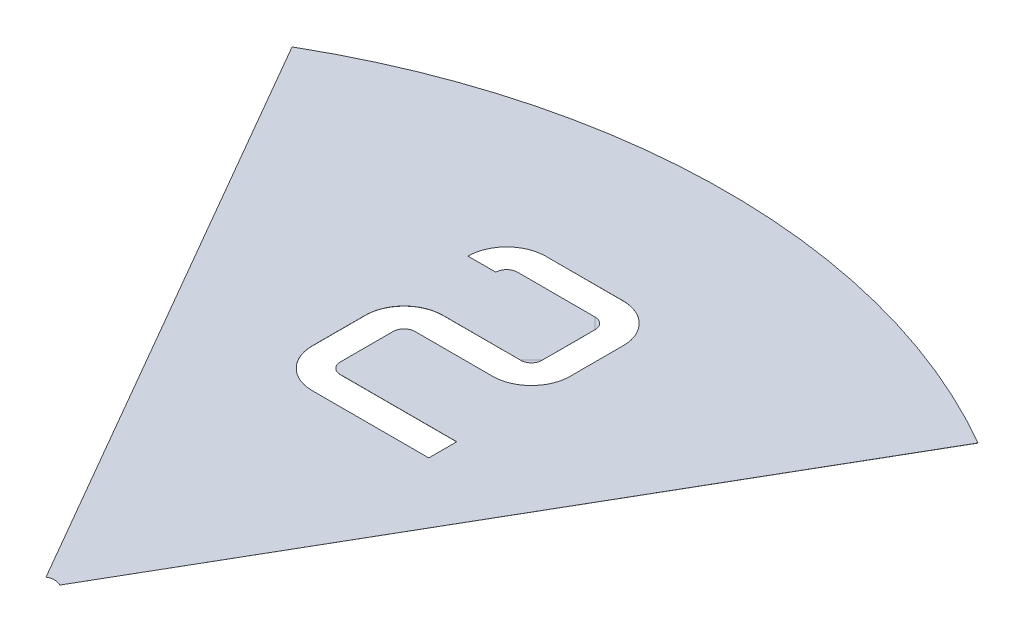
ISO-10303-21;
HEADER;
FILE_DESCRIPTION(('STEP AP214'),'2;1');
FILE_NAME('part.step','',(''),(''),'','','');
FILE_SCHEMA(('AUTOMOTIVE_DESIGN { 1 0 10303 214 1 1 1 1 }'));
ENDSEC;
DATA;
#1=APPLICATION_CONTEXT('core data for automotive mechanical design processes');
#2=APPLICATION_PROTOCOL_DEFINITION('international standard','automotive_design',2000,#1);
#3=PRODUCT_CONTEXT('',#1,'mechanical');
#4=PRODUCT('Part','Part','',(#3));
#5=PRODUCT_RELATED_PRODUCT_CATEGORY('part','',(#4));
#6=PRODUCT_DEFINITION_FORMATION('','',#4);
#7=PRODUCT_DEFINITION_CONTEXT('part definition',#1,'design');
#8=PRODUCT_DEFINITION('design','',#6,#7);
#9=PRODUCT_DEFINITION_SHAPE('','',#8);
#10=(LENGTH_UNIT() NAMED_UNIT(*) SI_UNIT(.MILLI.,.METRE.));
#11=(NAMED_UNIT(*) PLANE_ANGLE_UNIT() SI_UNIT($,.RADIAN.));
#12=(NAMED_UNIT(*) SI_UNIT($,.STERADIAN.) SOLID_ANGLE_UNIT());
#13=UNCERTAINTY_MEASURE_WITH_UNIT(LENGTH_MEASURE(1.E-05),#10,'distance_accuracy_value','');
#14=(GEOMETRIC_REPRESENTATION_CONTEXT(3) GLOBAL_UNCERTAINTY_ASSIGNED_CONTEXT((#13)) GLOBAL_UNIT_ASSIGNED_CONTEXT((#10,
#11,#12)) REPRESENTATION_CONTEXT('',''));
#15=CARTESIAN_POINT('',(0.,0.,0.));
#16=DIRECTION('',(0.,0.,1.));
#17=DIRECTION('',(1.,0.,0.));
#18=AXIS2_PLACEMENT_3D('',#15,#16,#17);
#19=CARTESIAN_POINT('',(-9.5843847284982,-10.5069257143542,12.2025933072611));
#20=DIRECTION('',(0.,1.,0.));
#21=DIRECTION('',(0.,0.,1.));
#22=AXIS2_PLACEMENT_3D('',#19,#20,#21);
#23=PLANE('',#22);
#24=CARTESIAN_POINT('',(-12.1469938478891,-10.5169257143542,-27.1362681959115));
#25=CARTESIAN_POINT('',(-12.6875323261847,-10.5169257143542,-27.1361535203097));
#26=CARTESIAN_POINT('',(-13.188885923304,-10.5169257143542,-26.9375339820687));
#27=CARTESIAN_POINT('',(-13.7345321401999,-10.5169257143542,-26.7213671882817));
#28=CARTESIAN_POINT('',(-14.1484595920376,-10.5169257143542,-26.30723394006));
#29=CARTESIAN_POINT('',(-14.5633603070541,-10.5169257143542,-25.8921269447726));
#30=CARTESIAN_POINT('',(-14.7787596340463,-10.5169257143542,-25.3476602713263));
#31=CARTESIAN_POINT('',(-14.9773793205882,-10.5169257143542,-24.8456076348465));
#32=CARTESIAN_POINT('',(-14.9774938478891,-10.5169257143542,-24.3057681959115));
#33=B_SPLINE_CURVE_WITH_KNOTS('',2,(#24,#25,#26,#27,#28,#29,#30,#31,#32),.UNSPECIFIED.,.F.,.F.,
(3,2,2,2,3),(0.,0.25,0.5,0.75,1.),.UNSPECIFIED.);
#34=CARTESIAN_POINT('',(-12.1469938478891,-10.5119257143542,-27.1362681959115));
#35=VERTEX_POINT('',#34);
#36=CARTESIAN_POINT('',(-14.9774938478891,-10.5119257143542,-24.3057681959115));
#37=VERTEX_POINT('',#36);
#38=EDGE_CURVE('E167',#35,#37,#33,.T.);
#39=ORIENTED_EDGE('',*,*,#38,.F.);
#40=DIRECTION('',(-1.,0.,0.));
#41=VECTOR('',#40,1.);
#42=CARTESIAN_POINT('',(-12.1469938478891,-10.5069257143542,-27.1362681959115));
#43=LINE('',#42,#41);
#44=CARTESIAN_POINT('',(-6.48599384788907,-10.5069257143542,-27.1362681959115));
#45=VERTEX_POINT('',#44);
#46=EDGE_CURVE('E377',#45,#35,#43,.T.);
#47=ORIENTED_EDGE('',*,*,#46,.F.);
#48=CARTESIAN_POINT('',(-6.48599384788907,-10.5069257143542,-24.3057681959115));
#49=DIRECTION('',(0.,1.,0.));
#50=DIRECTION('',(0.,0.,-1.));
#51=AXIS2_PLACEMENT_3D('',#48,#49,#50);
#52=CIRCLE('',#51,2.8305);
#53=CARTESIAN_POINT('',(-3.65549384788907,-10.5069257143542,-24.3057681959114));
#54=VERTEX_POINT('',#53);
#55=EDGE_CURVE('E380',#54,#45,#52,.T.);
#56=ORIENTED_EDGE('',*,*,#55,.F.);
#57=DIRECTION('',(0.,0.,-1.));
#58=VECTOR('',#57,1.);
#59=CARTESIAN_POINT('',(-3.65549384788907,-10.5069257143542,-24.3057681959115));
#60=LINE('',#59,#58);
#61=CARTESIAN_POINT('',(-3.65549384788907,-10.5069257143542,-20.4467681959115));
#62=VERTEX_POINT('',#61);
#63=EDGE_CURVE('E390',#62,#54,#60,.T.);
#64=ORIENTED_EDGE('',*,*,#63,.F.);
#65=CARTESIAN_POINT('',(-6.48599384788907,-10.5069257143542,-20.4467681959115));
#66=DIRECTION('',(0.,1.,0.));
#67=DIRECTION('',(0.,0.,-1.));
#68=AXIS2_PLACEMENT_3D('',#65,#66,#67);
#69=CIRCLE('',#68,2.8305);
#70=CARTESIAN_POINT('',(-6.48599384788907,-10.5069257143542,-17.6162681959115));
#71=VERTEX_POINT('',#70);
#72=EDGE_CURVE('E395',#71,#62,#69,.T.);
#73=ORIENTED_EDGE('',*,*,#72,.F.);
#74=DIRECTION('',(1.,0.,0.));
#75=VECTOR('',#74,1.);
#76=CARTESIAN_POINT('',(-12.1469938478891,-10.5069257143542,-17.6162681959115));
#77=LINE('',#76,#75);
#78=CARTESIAN_POINT('',(-12.1469938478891,-10.5069257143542,-17.6162681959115));
#79=VERTEX_POINT('',#78);
#80=EDGE_CURVE('E400',#79,#71,#77,.T.);
#81=ORIENTED_EDGE('',*,*,#80,.F.);
#82=CARTESIAN_POINT('',(-12.1469938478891,-10.5069257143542,-16.8257681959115));
#83=DIRECTION('',(0.,-1.,0.));
#84=DIRECTION('',(0.,0.,-1.));
#85=AXIS2_PLACEMENT_3D('',#82,#83,#84);
#86=CIRCLE('',#85,0.7905);
#87=CARTESIAN_POINT('',(-12.9374938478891,-10.5069257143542,-16.8257681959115));
#88=VERTEX_POINT('',#87);
#89=EDGE_CURVE('E405',#88,#79,#86,.T.);
#90=ORIENTED_EDGE('',*,*,#89,.F.);
#91=DIRECTION('',(0.,0.,-1.));
#92=VECTOR('',#91,1.);
#93=CARTESIAN_POINT('',(-12.9374938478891,-10.5069257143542,-12.9667681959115));
#94=LINE('',#93,#92);
#95=CARTESIAN_POINT('',(-12.9374938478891,-10.5069257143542,-12.9667681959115));
#96=VERTEX_POINT('',#95);
#97=EDGE_CURVE('E410',#96,#88,#94,.T.);
#98=ORIENTED_EDGE('',*,*,#97,.F.);
#99=CARTESIAN_POINT('',(-12.1469938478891,-10.5069257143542,-12.9667681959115));
#100=DIRECTION('',(0.,-1.,0.));
#101=DIRECTION('',(0.,0.,1.));
#102=AXIS2_PLACEMENT_3D('',#99,#100,#101);
#103=CIRCLE('',#102,0.7905);
#104=CARTESIAN_POINT('',(-12.1469938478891,-10.5069257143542,-12.1762681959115));
#105=VERTEX_POINT('',#104);
#106=EDGE_CURVE('E415',#105,#96,#103,.T.);
#107=ORIENTED_EDGE('',*,*,#106,.F.);
#108=DIRECTION('',(-1.,0.,0.));
#109=VECTOR('',#108,1.);
#110=CARTESIAN_POINT('',(-3.65549384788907,-10.5069257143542,-12.1762681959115));
#111=LINE('',#110,#109);
#112=CARTESIAN_POINT('',(-3.65549384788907,-10.5069257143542,-12.1762681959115));
#113=VERTEX_POINT('',#112);
#114=EDGE_CURVE('E412',#113,#105,#111,.T.);
#115=ORIENTED_EDGE('',*,*,#114,.F.);
#116=DIRECTION('',(0.,0.,-1.));
#117=VECTOR('',#116,1.);
#118=CARTESIAN_POINT('',(-3.65549384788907,-10.5069257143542,-12.1762681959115));
#119=LINE('',#118,#117);
#120=CARTESIAN_POINT('',(-3.65549384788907,-10.5069257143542,-10.1362681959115));
#121=VERTEX_POINT('',#120);
#122=EDGE_CURVE('E421',#121,#113,#119,.T.);
#123=ORIENTED_EDGE('',*,*,#122,.F.);
#124=DIRECTION('',(1.,0.,0.));
#125=VECTOR('',#124,1.);
#126=CARTESIAN_POINT('',(-3.65549384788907,-10.5069257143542,-10.1362681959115));
#127=LINE('',#126,#125);
#128=CARTESIAN_POINT('',(-12.1469938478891,-10.5069257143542,-10.1362681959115));
#129=VERTEX_POINT('',#128);
#130=EDGE_CURVE('E454',#129,#121,#127,.T.);
#131=ORIENTED_EDGE('',*,*,#130,.F.);
#132=CARTESIAN_POINT('',(-12.1469938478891,-10.5069257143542,-12.9667681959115));
#133=DIRECTION('',(0.,1.,0.));
#134=DIRECTION('',(0.,0.,1.));
#135=AXIS2_PLACEMENT_3D('',#132,#133,#134);
#136=CIRCLE('',#135,2.8305);
#137=CARTESIAN_POINT('',(-14.9774938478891,-10.5069257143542,-12.9667681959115));
#138=VERTEX_POINT('',#137);
#139=EDGE_CURVE('E448',#138,#129,#136,.T.);
#140=ORIENTED_EDGE('',*,*,#139,.F.);
#141=DIRECTION('',(-0.000685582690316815,0.,0.99999976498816));
#142=VECTOR('',#141,1.);
#143=CARTESIAN_POINT('',(-14.9774938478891,-10.5069257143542,-12.9667681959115));
#144=LINE('',#143,#142);
#145=CARTESIAN_POINT('',(-14.9749307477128,-10.5069257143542,-16.705339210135));
#146=VERTEX_POINT('',#145);
#147=EDGE_CURVE('E442',#146,#138,#144,.T.);
#148=ORIENTED_EDGE('',*,*,#147,.F.);
#149=CARTESIAN_POINT('',(-12.1469938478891,-10.5069257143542,-16.8257681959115));
#150=DIRECTION('',(0.,1.,0.));
#151=DIRECTION('',(0.,0.,1.));
#152=AXIS2_PLACEMENT_3D('',#149,#150,#151);
#153=CIRCLE('',#152,2.8305);
#154=CARTESIAN_POINT('',(-12.1469938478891,-10.5069257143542,-19.6562681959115));
#155=VERTEX_POINT('',#154);
#156=EDGE_CURVE('E434',#155,#146,#153,.T.);
#157=ORIENTED_EDGE('',*,*,#156,.F.);
#158=DIRECTION('',(-1.,0.,0.));
#159=VECTOR('',#158,1.);
#160=CARTESIAN_POINT('',(-12.1469938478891,-10.5069257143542,-19.6562681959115));
#161=LINE('',#160,#159);
#162=CARTESIAN_POINT('',(-6.48599384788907,-10.5119257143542,-19.6562681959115));
#163=VERTEX_POINT('',#162);
#164=EDGE_CURVE('E431',#163,#155,#161,.T.);
#165=ORIENTED_EDGE('',*,*,#164,.F.);
#166=CARTESIAN_POINT('',(-5.69549384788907,-10.5169257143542,-20.4467681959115));
#167=CARTESIAN_POINT('',(-5.69682991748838,-10.5169257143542,-20.1158325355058));
#168=CARTESIAN_POINT('',(-5.92702593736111,-10.5169257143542,-19.8878002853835));
#169=CARTESIAN_POINT('',(-6.15942405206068,-10.5169257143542,-19.657586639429));
#170=CARTESIAN_POINT('',(-6.48599384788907,-10.5169257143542,-19.6562681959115));
#171=B_SPLINE_CURVE_WITH_KNOTS('',2,(#166,#167,#168,#169,#170),.UNSPECIFIED.,.F.,.F.,(3,2,3),
(0.,0.5,1.),.UNSPECIFIED.);
#172=CARTESIAN_POINT('',(-5.69549384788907,-10.5119257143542,-20.4467681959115));
#173=VERTEX_POINT('',#172);
#174=EDGE_CURVE('E234',#173,#163,#171,.T.);
#175=ORIENTED_EDGE('',*,*,#174,.F.);
#176=DIRECTION('',(0.,0.,1.));
#177=VECTOR('',#176,1.);
#178=CARTESIAN_POINT('',(-5.69549384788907,-10.5069257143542,-24.3057681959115));
#179=LINE('',#178,#177);
#180=CARTESIAN_POINT('',(-5.69549384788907,-10.5119257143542,-24.3057681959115));
#181=VERTEX_POINT('',#180);
#182=EDGE_CURVE('E375',#181,#173,#179,.T.);
#183=ORIENTED_EDGE('',*,*,#182,.F.);
#184=CARTESIAN_POINT('',(-6.48599384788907,-10.5169257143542,-25.0962681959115));
#185=CARTESIAN_POINT('',(-6.15505818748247,-10.5169257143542,-25.0949321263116));
#186=CARTESIAN_POINT('',(-5.92702593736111,-10.5169257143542,-24.8647361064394));
#187=CARTESIAN_POINT('',(-5.69681229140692,-10.5169257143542,-24.6323379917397));
#188=CARTESIAN_POINT('',(-5.69549384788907,-10.5169257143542,-24.3057681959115));
#189=B_SPLINE_CURVE_WITH_KNOTS('',2,(#184,#185,#186,#187,#188),.UNSPECIFIED.,.F.,.F.,(3,2,3),
(0.,0.5,1.),.UNSPECIFIED.);
#190=CARTESIAN_POINT('',(-6.48599384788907,-10.5119257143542,-25.0962681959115));
#191=VERTEX_POINT('',#190);
#192=EDGE_CURVE('E248',#191,#181,#189,.T.);
#193=ORIENTED_EDGE('',*,*,#192,.F.);
#194=DIRECTION('',(1.,0.,0.));
#195=VECTOR('',#194,1.);
#196=CARTESIAN_POINT('',(-12.1469938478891,-10.5069257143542,-25.0962681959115));
#197=LINE('',#196,#195);
#198=CARTESIAN_POINT('',(-12.1469938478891,-10.5069257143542,-25.0962681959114));
#199=VERTEX_POINT('',#198);
#200=EDGE_CURVE('E173',#199,#191,#197,.T.);
#201=ORIENTED_EDGE('',*,*,#200,.F.);
#202=CARTESIAN_POINT('',(-12.1469938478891,-10.5069257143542,-24.3057681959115));
#203=DIRECTION('',(0.,-1.,0.));
#204=DIRECTION('',(0.,0.,1.));
#205=AXIS2_PLACEMENT_3D('',#202,#203,#204);
#206=CIRCLE('',#205,0.7905);
#207=CARTESIAN_POINT('',(-12.9374938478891,-10.5069257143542,-24.3057681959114));
#208=VERTEX_POINT('',#207);
#209=EDGE_CURVE('E170',#208,#199,#206,.T.);
#210=ORIENTED_EDGE('',*,*,#209,.F.);
#211=DIRECTION('',(1.,0.,0.));
#212=VECTOR('',#211,1.);
#213=CARTESIAN_POINT('',(-14.9774938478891,-10.5069257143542,-24.3057681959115));
#214=LINE('',#213,#212);
#215=EDGE_CURVE('E162',#37,#208,#214,.T.);
#216=ORIENTED_EDGE('',*,*,#215,.F.);
#217=EDGE_LOOP('',(#39,#47,#56,#64,#73,#81,#90,#98,#107,#115,#123,#131,#140,#148,#157,#165,#175,
#183,#193,#201,#210,#216));
#218=FACE_BOUND('',#217,.T.);
#219=CARTESIAN_POINT('',(-10.0843847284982,-10.5069257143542,11.3365679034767));
#220=CARTESIAN_POINT('',(-9.84938651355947,-10.5069257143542,11.2017838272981));
#221=CARTESIAN_POINT('',(-9.58438472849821,-10.5069257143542,11.2025933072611));
#222=CARTESIAN_POINT('',(-9.31654514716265,-10.5069257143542,11.2034114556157));
#223=CARTESIAN_POINT('',(-9.08438472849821,-10.5069257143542,11.3365679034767));
#224=B_SPLINE_CURVE_WITH_KNOTS('',2,(#219,#220,#221,#222,#223),.UNSPECIFIED.,.F.,.F.,(3,2,3),
(0.,0.5,1.),.UNSPECIFIED.);
#225=CARTESIAN_POINT('',(-10.0843847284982,-10.5119257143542,11.3365679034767));
#226=VERTEX_POINT('',#225);
#227=CARTESIAN_POINT('',(-9.08438472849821,-10.5119257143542,11.3365679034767));
#228=VERTEX_POINT('',#227);
#229=EDGE_CURVE('E26',#226,#228,#224,.T.);
#230=ORIENTED_EDGE('',*,*,#229,.T.);
#231=DIRECTION('',(0.499999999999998,0.,-0.86602540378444));
#232=VECTOR('',#231,1.);
#233=CARTESIAN_POINT('',(-9.08438472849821,-10.5069257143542,11.3365679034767));
#234=LINE('',#233,#232);
#235=CARTESIAN_POINT('',(15.4156152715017,-10.5069257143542,-31.0986768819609));
#236=VERTEX_POINT('',#235);
#237=EDGE_CURVE('E191',#228,#236,#234,.T.);
#238=ORIENTED_EDGE('',*,*,#237,.T.);
#239=CARTESIAN_POINT('',(-9.5843847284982,-10.5069257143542,12.2025933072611));
#240=DIRECTION('',(0.,1.,0.));
#241=DIRECTION('',(0.,0.,1.));
#242=AXIS2_PLACEMENT_3D('',#239,#240,#241);
#243=CIRCLE('',#242,50.);
#244=CARTESIAN_POINT('',(-34.5843847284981,-10.5069257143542,-31.0986768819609));
#245=VERTEX_POINT('',#244);
#246=EDGE_CURVE('E309',#236,#245,#243,.T.);
#247=ORIENTED_EDGE('',*,*,#246,.T.);
#248=DIRECTION('',(0.499999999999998,0.,0.86602540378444));
#249=VECTOR('',#248,1.);
#250=CARTESIAN_POINT('',(-10.0843847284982,-10.5069257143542,11.3365679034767));
#251=LINE('',#250,#249);
#252=EDGE_CURVE('E308',#245,#226,#251,.T.);
#253=ORIENTED_EDGE('',*,*,#252,.T.);
#254=EDGE_LOOP('',(#230,#238,#247,#253));
#255=FACE_BOUND('',#254,.T.);
#256=ADVANCED_FACE('F14',(#218,#255),#23,.T.);
#257=CARTESIAN_POINT('',(-3.65549384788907,-20.5069257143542,-12.1762681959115));
#258=DIRECTION('',(1.,0.,0.));
#259=DIRECTION('',(0.,0.,-1.));
#260=AXIS2_PLACEMENT_3D('',#257,#258,#259);
#261=PLANE('',#260);
#262=DIRECTION('',(0.,1.,0.));
#263=VECTOR('',#262,1.);
#264=CARTESIAN_POINT('',(-3.65549384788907,-20.5069257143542,-10.1362681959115));
#265=LINE('',#264,#263);
#266=CARTESIAN_POINT('',(-3.65549401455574,-10.5169257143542,-10.1362681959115));
#267=VERTEX_POINT('',#266);
#268=EDGE_CURVE('E424',#267,#121,#265,.T.);
#269=ORIENTED_EDGE('',*,*,#268,.T.);
#270=ORIENTED_EDGE('',*,*,#122,.T.);
#271=DIRECTION('',(0.,1.,0.));
#272=VECTOR('',#271,1.);
#273=CARTESIAN_POINT('',(-3.65549384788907,-20.5069257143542,-12.1762681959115));
#274=LINE('',#273,#272);
#275=CARTESIAN_POINT('',(-3.65549384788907,-10.5169257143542,-12.1762680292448));
#276=VERTEX_POINT('',#275);
#277=EDGE_CURVE('E423',#276,#113,#274,.T.);
#278=ORIENTED_EDGE('',*,*,#277,.F.);
#279=CARTESIAN_POINT('',(-3.65549384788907,-10.5169257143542,-10.1362681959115));
#280=CARTESIAN_POINT('',(-3.65549384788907,-10.5169257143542,-12.1762681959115));
#281=B_SPLINE_CURVE_WITH_KNOTS('',1,(#279,#280),.UNSPECIFIED.,.F.,.F.,(2,2),(0.,1.),.UNSPECIFIED.);
#282=EDGE_CURVE('E664',#267,#276,#281,.T.);
#283=ORIENTED_EDGE('',*,*,#282,.F.);
#284=EDGE_LOOP('',(#269,#270,#278,#283));
#285=FACE_BOUND('',#284,.T.);
#286=ADVANCED_FACE('F205',(#285),#261,.F.);
#287=CARTESIAN_POINT('',(-3.65549384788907,-20.5069257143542,-10.1362681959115));
#288=DIRECTION('',(0.,0.,1.));
#289=DIRECTION('',(1.,0.,0.));
#290=AXIS2_PLACEMENT_3D('',#287,#288,#289);
#291=PLANE('',#290);
#292=DIRECTION('',(0.,1.,0.));
#293=VECTOR('',#292,1.);
#294=CARTESIAN_POINT('',(-12.1469938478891,-20.5069257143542,-10.1362681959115));
#295=LINE('',#294,#293);
#296=CARTESIAN_POINT('',(-12.1469938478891,-10.5169257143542,-10.1362681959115));
#297=VERTEX_POINT('',#296);
#298=EDGE_CURVE('E457',#297,#129,#295,.T.);
#299=ORIENTED_EDGE('',*,*,#298,.T.);
#300=ORIENTED_EDGE('',*,*,#130,.T.);
#301=ORIENTED_EDGE('',*,*,#268,.F.);
#302=CARTESIAN_POINT('',(-12.1469938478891,-10.5169257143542,-10.1362681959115));
#303=CARTESIAN_POINT('',(-3.65549384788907,-10.5169257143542,-10.1362681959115));
#304=B_SPLINE_CURVE_WITH_KNOTS('',1,(#302,#303),.UNSPECIFIED.,.F.,.F.,(2,2),(0.,1.),.UNSPECIFIED.);
#305=EDGE_CURVE('E674',#297,#267,#304,.T.);
#306=ORIENTED_EDGE('',*,*,#305,.F.);
#307=EDGE_LOOP('',(#299,#300,#301,#306));
#308=FACE_BOUND('',#307,.T.);
#309=ADVANCED_FACE('F728',(#308),#291,.F.);
#310=CARTESIAN_POINT('',(-12.1469938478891,-20.5069257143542,-12.9667681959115));
#311=DIRECTION('',(0.,1.,0.));
#312=DIRECTION('',(0.,0.,1.));
#313=AXIS2_PLACEMENT_3D('',#310,#311,#312);
#314=CYLINDRICAL_SURFACE('',#313,2.8305);
#315=DIRECTION('',(0.,1.,0.));
#316=VECTOR('',#315,1.);
#317=CARTESIAN_POINT('',(-14.9774938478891,-20.5069257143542,-12.9667681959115));
#318=LINE('',#317,#316);
#319=CARTESIAN_POINT('',(-14.9774938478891,-10.5169257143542,-12.9667681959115));
#320=VERTEX_POINT('',#319);
#321=EDGE_CURVE('E451',#320,#138,#318,.T.);
#322=ORIENTED_EDGE('',*,*,#321,.T.);
#323=ORIENTED_EDGE('',*,*,#139,.T.);
#324=ORIENTED_EDGE('',*,*,#298,.F.);
#325=CARTESIAN_POINT('',(-14.9774938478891,-10.5169257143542,-12.9667681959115));
#326=CARTESIAN_POINT('',(-14.9774457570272,-10.5169257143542,-12.7065577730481));
#327=CARTESIAN_POINT('',(-14.9302396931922,-10.5169257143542,-12.4517217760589));
#328=CARTESIAN_POINT('',(-14.8799832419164,-10.5169257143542,-12.1804186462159));
#329=CARTESIAN_POINT('',(-14.7787596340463,-10.5169257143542,-11.9248761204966));
#330=CARTESIAN_POINT('',(-14.672888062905,-10.5169257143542,-11.6575996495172));
#331=CARTESIAN_POINT('',(-14.5161096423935,-10.5169257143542,-11.4178909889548));
#332=CARTESIAN_POINT('',(-14.3553913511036,-10.5169257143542,-11.1721584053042));
#333=CARTESIAN_POINT('',(-14.1484595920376,-10.5169257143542,-10.9653024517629));
#334=CARTESIAN_POINT('',(-13.9407982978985,-10.5169257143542,-10.7577172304));
#335=CARTESIAN_POINT('',(-13.6958710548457,-10.5169257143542,-10.5976524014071));
#336=CARTESIAN_POINT('',(-13.455221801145,-10.5169257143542,-10.4403833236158));
#337=CARTESIAN_POINT('',(-13.188885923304,-10.5169257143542,-10.3350024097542));
#338=CARTESIAN_POINT('',(-12.9323207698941,-10.5169257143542,-10.233487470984));
#339=CARTESIAN_POINT('',(-12.6620402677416,-10.5169257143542,-10.1835223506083));
#340=CARTESIAN_POINT('',(-12.4066840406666,-10.5169257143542,-10.1363161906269));
#341=CARTESIAN_POINT('',(-12.1469938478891,-10.5169257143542,-10.1362681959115));
#342=B_SPLINE_CURVE_WITH_KNOTS('',2,(#325,#326,#327,#328,#329,#330,#331,#332,#333,#334,#335,
#336,#337,#338,#339,#340,#341),.UNSPECIFIED.,.F.,.F.,(3,2,2,2,2,2,2,2,3),(0.,0.125,0.25,0.375,
0.5,0.625,0.75,0.875,1.),.UNSPECIFIED.);
#343=EDGE_CURVE('E488',#320,#297,#342,.T.);
#344=ORIENTED_EDGE('',*,*,#343,.F.);
#345=EDGE_LOOP('',(#322,#323,#324,#344));
#346=FACE_BOUND('',#345,.T.);
#347=ADVANCED_FACE('F696',(#346),#314,.F.);
#348=CARTESIAN_POINT('',(-14.9774938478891,-20.5069257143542,-12.9667681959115));
#349=DIRECTION('',(-0.99999976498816,0.,-0.000685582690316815));
#350=DIRECTION('',(-0.000685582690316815,0.,0.99999976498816));
#351=AXIS2_PLACEMENT_3D('',#348,#349,#350);
#352=PLANE('',#351);
#353=DIRECTION('',(0.,1.,0.));
#354=VECTOR('',#353,1.);
#355=CARTESIAN_POINT('',(-14.9749307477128,-20.5069257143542,-16.705339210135));
#356=LINE('',#355,#354);
#357=CARTESIAN_POINT('',(-14.9749307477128,-10.5169257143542,-16.705339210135));
#358=VERTEX_POINT('',#357);
#359=EDGE_CURVE('E445',#358,#146,#356,.T.);
#360=ORIENTED_EDGE('',*,*,#359,.T.);
#361=ORIENTED_EDGE('',*,*,#147,.T.);
#362=ORIENTED_EDGE('',*,*,#321,.F.);
#363=CARTESIAN_POINT('',(-14.9749307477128,-10.5169257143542,-16.705339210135));
#364=CARTESIAN_POINT('',(-14.9774938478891,-10.5169257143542,-12.9667681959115));
#365=B_SPLINE_CURVE_WITH_KNOTS('',1,(#363,#364),.UNSPECIFIED.,.F.,.F.,(2,2),(0.,1.),.UNSPECIFIED.);
#366=EDGE_CURVE('E252',#358,#320,#365,.T.);
#367=ORIENTED_EDGE('',*,*,#366,.F.);
#368=EDGE_LOOP('',(#360,#361,#362,#367));
#369=FACE_BOUND('',#368,.T.);
#370=ADVANCED_FACE('F694',(#369),#352,.F.);
#371=CARTESIAN_POINT('',(-12.1469938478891,-20.5069257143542,-16.8257681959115));
#372=DIRECTION('',(0.,1.,0.));
#373=DIRECTION('',(0.,0.,1.));
#374=AXIS2_PLACEMENT_3D('',#371,#372,#373);
#375=CYLINDRICAL_SURFACE('',#374,2.8305);
#376=DIRECTION('',(0.,1.,0.));
#377=VECTOR('',#376,1.);
#378=CARTESIAN_POINT('',(-12.1469938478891,-20.5069257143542,-19.6562681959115));
#379=LINE('',#378,#377);
#380=CARTESIAN_POINT('',(-12.1469938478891,-10.5169257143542,-19.6562681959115));
#381=VERTEX_POINT('',#380);
#382=EDGE_CURVE('E439',#381,#155,#379,.T.);
#383=ORIENTED_EDGE('',*,*,#382,.T.);
#384=ORIENTED_EDGE('',*,*,#156,.T.);
#385=ORIENTED_EDGE('',*,*,#359,.F.);
#386=CARTESIAN_POINT('',(-12.1469938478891,-10.5169257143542,-19.6562681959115));
#387=CARTESIAN_POINT('',(-12.4131898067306,-10.5169257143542,-19.6562196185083));
#388=CARTESIAN_POINT('',(-12.6737173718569,-10.5169257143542,-19.6068278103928));
#389=CARTESIAN_POINT('',(-12.9519519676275,-10.5169257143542,-19.5540790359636));
#390=CARTESIAN_POINT('',(-13.2132865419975,-10.5169257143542,-19.447742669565));
#391=CARTESIAN_POINT('',(-13.4872477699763,-10.5169257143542,-19.3362685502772));
#392=CARTESIAN_POINT('',(-13.731438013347,-10.5169257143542,-19.171246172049));
#393=CARTESIAN_POINT('',(-13.9820573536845,-10.5169257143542,-19.0018790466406));
#394=CARTESIAN_POINT('',(-14.1905941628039,-10.5169257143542,-18.7841930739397));
#395=CARTESIAN_POINT('',(-14.3998416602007,-10.5169257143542,-18.5657652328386));
#396=CARTESIAN_POINT('',(-14.5577611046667,-10.5169257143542,-18.3089847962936));
#397=CARTESIAN_POINT('',(-14.7127040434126,-10.5169257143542,-18.0570442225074));
#398=CARTESIAN_POINT('',(-14.8119614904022,-10.5169257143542,-17.7795384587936));
#399=CARTESIAN_POINT('',(-14.9073350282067,-10.5169257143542,-17.5128913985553));
#400=CARTESIAN_POINT('',(-14.9479455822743,-10.5169257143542,-17.2336893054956));
#401=CARTESIAN_POINT('',(-14.9861861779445,-10.5169257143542,-16.970780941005));
#402=CARTESIAN_POINT('',(-14.9749307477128,-10.5169257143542,-16.705339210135));
#403=B_SPLINE_CURVE_WITH_KNOTS('',2,(#386,#387,#388,#389,#390,#391,#392,#393,#394,#395,#396,
#397,#398,#399,#400,#401,#402),.UNSPECIFIED.,.F.,.F.,(3,2,2,2,2,2,2,2,3),(0.,0.125,0.25,0.375,
0.5,0.625,0.75,0.875,1.),.UNSPECIFIED.);
#404=EDGE_CURVE('E250',#381,#358,#403,.T.);
#405=ORIENTED_EDGE('',*,*,#404,.F.);
#406=EDGE_LOOP('',(#383,#384,#385,#405));
#407=FACE_BOUND('',#406,.T.);
#408=ADVANCED_FACE('F715',(#407),#375,.F.);
#409=CARTESIAN_POINT('',(-12.1469938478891,-20.5069257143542,-19.6562681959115));
#410=DIRECTION('',(0.,0.,-1.));
#411=DIRECTION('',(-1.,0.,0.));
#412=AXIS2_PLACEMENT_3D('',#409,#410,#411);
#413=PLANE('',#412);
#414=ORIENTED_EDGE('',*,*,#164,.T.);
#415=ORIENTED_EDGE('',*,*,#382,.F.);
#416=CARTESIAN_POINT('',(-6.48599384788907,-10.5169257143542,-19.6562681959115));
#417=CARTESIAN_POINT('',(-12.1469938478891,-10.5169257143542,-19.6562681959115));
#418=B_SPLINE_CURVE_WITH_KNOTS('',1,(#416,#417),.UNSPECIFIED.,.F.,.F.,(2,2),(0.,1.),.UNSPECIFIED.);
#419=EDGE_CURVE('E244',#163,#381,#418,.T.);
#420=ORIENTED_EDGE('',*,*,#419,.F.);
#421=EDGE_LOOP('',(#414,#415,#420));
#422=FACE_BOUND('',#421,.T.);
#423=ADVANCED_FACE('F529',(#422),#413,.F.);
#424=CARTESIAN_POINT('',(-12.1469938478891,-20.5069257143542,-12.9667681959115));
#425=DIRECTION('',(0.,1.,0.));
#426=DIRECTION('',(0.,0.,1.));
#427=AXIS2_PLACEMENT_3D('',#424,#425,#426);
#428=CYLINDRICAL_SURFACE('',#427,0.7905);
#429=DIRECTION('',(0.,1.,0.));
#430=VECTOR('',#429,1.);
#431=CARTESIAN_POINT('',(-12.1469938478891,-20.5069257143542,-12.1762681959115));
#432=LINE('',#431,#430);
#433=CARTESIAN_POINT('',(-12.1469938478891,-10.5169257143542,-12.1762681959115));
#434=VERTEX_POINT('',#433);
#435=EDGE_CURVE('E418',#434,#105,#432,.T.);
#436=ORIENTED_EDGE('',*,*,#435,.T.);
#437=ORIENTED_EDGE('',*,*,#106,.T.);
#438=DIRECTION('',(0.,1.,0.));
#439=VECTOR('',#438,1.);
#440=CARTESIAN_POINT('',(-12.9374938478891,-20.5069257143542,-12.9667681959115));
#441=LINE('',#440,#439);
#442=CARTESIAN_POINT('',(-12.9374938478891,-10.5169257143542,-12.9667681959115));
#443=VERTEX_POINT('',#442);
#444=EDGE_CURVE('E417',#443,#96,#441,.T.);
#445=ORIENTED_EDGE('',*,*,#444,.F.);
#446=CARTESIAN_POINT('',(-12.1469938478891,-10.5169257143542,-12.9667681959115));
#447=DIRECTION('',(0.,1.,0.));
#448=DIRECTION('',(-1.,0.,0.));
#449=AXIS2_PLACEMENT_3D('',#446,#447,#448);
#450=CIRCLE('',#449,0.7905);
#451=EDGE_CURVE('E511',#443,#434,#450,.T.);
#452=ORIENTED_EDGE('',*,*,#451,.T.);
#453=EDGE_LOOP('',(#436,#437,#445,#452));
#454=FACE_BOUND('',#453,.T.);
#455=ADVANCED_FACE('F518',(#454),#428,.T.);
#456=CARTESIAN_POINT('',(-3.65549384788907,-20.5069257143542,-12.1762681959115));
#457=DIRECTION('',(0.,0.,-1.));
#458=DIRECTION('',(-1.,0.,0.));
#459=AXIS2_PLACEMENT_3D('',#456,#457,#458);
#460=PLANE('',#459);
#461=ORIENTED_EDGE('',*,*,#277,.T.);
#462=ORIENTED_EDGE('',*,*,#114,.T.);
#463=ORIENTED_EDGE('',*,*,#435,.F.);
#464=CARTESIAN_POINT('',(-3.65549384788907,-10.5169257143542,-12.1762681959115));
#465=CARTESIAN_POINT('',(-12.1469938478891,-10.5169257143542,-12.1762681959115));
#466=B_SPLINE_CURVE_WITH_KNOTS('',1,(#464,#465),.UNSPECIFIED.,.F.,.F.,(2,2),(0.,1.),.UNSPECIFIED.);
#467=EDGE_CURVE('E659',#276,#434,#466,.T.);
#468=ORIENTED_EDGE('',*,*,#467,.F.);
#469=EDGE_LOOP('',(#461,#462,#463,#468));
#470=FACE_BOUND('',#469,.T.);
#471=ADVANCED_FACE('F528',(#470),#460,.F.);
#472=CARTESIAN_POINT('',(-12.9374938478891,-20.5069257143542,-12.9667681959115));
#473=DIRECTION('',(1.,0.,0.));
#474=DIRECTION('',(0.,0.,-1.));
#475=AXIS2_PLACEMENT_3D('',#472,#473,#474);
#476=PLANE('',#475);
#477=ORIENTED_EDGE('',*,*,#444,.T.);
#478=ORIENTED_EDGE('',*,*,#97,.T.);
#479=DIRECTION('',(0.,1.,0.));
#480=VECTOR('',#479,1.);
#481=CARTESIAN_POINT('',(-12.9374938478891,-20.5069257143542,-16.8257681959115));
#482=LINE('',#481,#480);
#483=CARTESIAN_POINT('',(-12.9374938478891,-10.5169257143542,-16.8257681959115));
#484=VERTEX_POINT('',#483);
#485=EDGE_CURVE('E407',#484,#88,#482,.T.);
#486=ORIENTED_EDGE('',*,*,#485,.F.);
#487=CARTESIAN_POINT('',(-12.9374938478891,-10.5169257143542,-12.9667681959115));
#488=CARTESIAN_POINT('',(-12.9374938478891,-10.5169257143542,-16.8257681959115));
#489=B_SPLINE_CURVE_WITH_KNOTS('',1,(#487,#488),.UNSPECIFIED.,.F.,.F.,(2,2),(0.,1.),.UNSPECIFIED.);
#490=EDGE_CURVE('E650',#443,#484,#489,.T.);
#491=ORIENTED_EDGE('',*,*,#490,.F.);
#492=EDGE_LOOP('',(#477,#478,#486,#491));
#493=FACE_BOUND('',#492,.T.);
#494=ADVANCED_FACE('F533',(#493),#476,.F.);
#495=CARTESIAN_POINT('',(-12.1469938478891,-20.5069257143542,-16.8257681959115));
#496=DIRECTION('',(0.,1.,0.));
#497=DIRECTION('',(0.,0.,1.));
#498=AXIS2_PLACEMENT_3D('',#495,#496,#497);
#499=CYLINDRICAL_SURFACE('',#498,0.7905);
#500=ORIENTED_EDGE('',*,*,#485,.T.);
#501=ORIENTED_EDGE('',*,*,#89,.T.);
#502=DIRECTION('',(0.,1.,0.));
#503=VECTOR('',#502,1.);
#504=CARTESIAN_POINT('',(-12.1469938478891,-20.5069257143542,-17.6162681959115));
#505=LINE('',#504,#503);
#506=CARTESIAN_POINT('',(-12.1469938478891,-10.5169257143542,-17.6162681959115));
#507=VERTEX_POINT('',#506);
#508=EDGE_CURVE('E402',#507,#79,#505,.T.);
#509=ORIENTED_EDGE('',*,*,#508,.F.);
#510=CARTESIAN_POINT('',(-12.1469938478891,-10.5169257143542,-16.8257681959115));
#511=DIRECTION('',(0.,1.,0.));
#512=DIRECTION('',(0.,0.,-1.));
#513=AXIS2_PLACEMENT_3D('',#510,#511,#512);
#514=CIRCLE('',#513,0.7905);
#515=EDGE_CURVE('E565',#507,#484,#514,.T.);
#516=ORIENTED_EDGE('',*,*,#515,.T.);
#517=EDGE_LOOP('',(#500,#501,#509,#516));
#518=FACE_BOUND('',#517,.T.);
#519=ADVANCED_FACE('F537',(#518),#499,.T.);
#520=CARTESIAN_POINT('',(-12.1469938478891,-20.5069257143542,-17.6162681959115));
#521=DIRECTION('',(0.,0.,1.));
#522=DIRECTION('',(1.,0.,0.));
#523=AXIS2_PLACEMENT_3D('',#520,#521,#522);
#524=PLANE('',#523);
#525=ORIENTED_EDGE('',*,*,#508,.T.);
#526=ORIENTED_EDGE('',*,*,#80,.T.);
#527=DIRECTION('',(0.,1.,0.));
#528=VECTOR('',#527,1.);
#529=CARTESIAN_POINT('',(-6.48599384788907,-20.5069257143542,-17.6162681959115));
#530=LINE('',#529,#528);
#531=CARTESIAN_POINT('',(-6.48599384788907,-10.5169257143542,-17.6162681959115));
#532=VERTEX_POINT('',#531);
#533=EDGE_CURVE('E397',#532,#71,#530,.T.);
#534=ORIENTED_EDGE('',*,*,#533,.F.);
#535=CARTESIAN_POINT('',(-12.1469938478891,-10.5169257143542,-17.6162681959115));
#536=CARTESIAN_POINT('',(-6.48599384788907,-10.5169257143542,-17.6162681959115));
#537=B_SPLINE_CURVE_WITH_KNOTS('',1,(#535,#536),.UNSPECIFIED.,.F.,.F.,(2,2),(0.,1.),.UNSPECIFIED.);
#538=EDGE_CURVE('E641',#507,#532,#537,.T.);
#539=ORIENTED_EDGE('',*,*,#538,.F.);
#540=EDGE_LOOP('',(#525,#526,#534,#539));
#541=FACE_BOUND('',#540,.T.);
#542=ADVANCED_FACE('F542',(#541),#524,.F.);
#543=CARTESIAN_POINT('',(-6.48599384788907,-20.5069257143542,-20.4467681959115));
#544=DIRECTION('',(0.,1.,0.));
#545=DIRECTION('',(0.,0.,1.));
#546=AXIS2_PLACEMENT_3D('',#543,#544,#545);
#547=CYLINDRICAL_SURFACE('',#546,2.8305);
#548=ORIENTED_EDGE('',*,*,#533,.T.);
#549=ORIENTED_EDGE('',*,*,#72,.T.);
#550=DIRECTION('',(0.,1.,0.));
#551=VECTOR('',#550,1.);
#552=CARTESIAN_POINT('',(-3.65549384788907,-20.5069257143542,-20.4467681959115));
#553=LINE('',#552,#551);
#554=CARTESIAN_POINT('',(-3.65549384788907,-10.5169257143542,-20.4467681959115));
#555=VERTEX_POINT('',#554);
#556=EDGE_CURVE('E392',#555,#62,#553,.T.);
#557=ORIENTED_EDGE('',*,*,#556,.F.);
#558=CARTESIAN_POINT('',(-6.48599384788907,-10.5169257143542,-17.6162681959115));
#559=CARTESIAN_POINT('',(-6.2257834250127,-10.5169257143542,-17.616316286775));
#560=CARTESIAN_POINT('',(-5.9709474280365,-10.5169257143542,-17.6635223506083));
#561=CARTESIAN_POINT('',(-5.69964429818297,-10.5169257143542,-17.7137788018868));
#562=CARTESIAN_POINT('',(-5.44410177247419,-10.5169257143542,-17.8150024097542));
#563=CARTESIAN_POINT('',(-5.17682530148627,-10.5169257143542,-17.9208739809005));
#564=CARTESIAN_POINT('',(-4.93711664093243,-10.5169257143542,-18.0776524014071));
#565=CARTESIAN_POINT('',(-4.69138405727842,-10.5169257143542,-18.2383706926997));
#566=CARTESIAN_POINT('',(-4.48452810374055,-10.5169257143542,-18.4453024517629));
#567=CARTESIAN_POINT('',(-4.27694288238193,-10.5169257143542,-18.6529637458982));
#568=CARTESIAN_POINT('',(-4.11687805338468,-10.5169257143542,-18.8978909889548));
#569=CARTESIAN_POINT('',(-3.95960897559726,-10.5169257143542,-19.1385402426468));
#570=CARTESIAN_POINT('',(-3.85422806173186,-10.5169257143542,-19.4048761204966));
#571=CARTESIAN_POINT('',(-3.75271312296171,-10.5169257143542,-19.6614412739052));
#572=CARTESIAN_POINT('',(-3.70274800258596,-10.5169257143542,-19.9317217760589));
#573=CARTESIAN_POINT('',(-3.65554184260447,-10.5169257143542,-20.1870780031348));
#574=CARTESIAN_POINT('',(-3.65549384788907,-10.5169257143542,-20.4467681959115));
#575=B_SPLINE_CURVE_WITH_KNOTS('',2,(#558,#559,#560,#561,#562,#563,#564,#565,#566,#567,#568,
#569,#570,#571,#572,#573,#574),.UNSPECIFIED.,.F.,.F.,(3,2,2,2,2,2,2,2,3),(0.,0.125,0.25,0.375,
0.5,0.625,0.75,0.875,1.),.UNSPECIFIED.);
#576=EDGE_CURVE('E582',#532,#555,#575,.T.);
#577=ORIENTED_EDGE('',*,*,#576,.F.);
#578=EDGE_LOOP('',(#548,#549,#557,#577));
#579=FACE_BOUND('',#578,.T.);
#580=ADVANCED_FACE('F587',(#579),#547,.F.);
#581=CARTESIAN_POINT('',(-3.65549384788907,-20.5069257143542,-24.3057681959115));
#582=DIRECTION('',(1.,0.,0.));
#583=DIRECTION('',(0.,0.,-1.));
#584=AXIS2_PLACEMENT_3D('',#581,#582,#583);
#585=PLANE('',#584);
#586=ORIENTED_EDGE('',*,*,#556,.T.);
#587=ORIENTED_EDGE('',*,*,#63,.T.);
#588=DIRECTION('',(0.,1.,0.));
#589=VECTOR('',#588,1.);
#590=CARTESIAN_POINT('',(-3.65549384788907,-20.5069257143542,-24.3057681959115));
#591=LINE('',#590,#589);
#592=CARTESIAN_POINT('',(-3.65549384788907,-10.5169257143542,-24.3057681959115));
#593=VERTEX_POINT('',#592);
#594=EDGE_CURVE('E383',#593,#54,#591,.T.);
#595=ORIENTED_EDGE('',*,*,#594,.F.);
#596=CARTESIAN_POINT('',(-3.65549384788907,-10.5169257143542,-20.4467681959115));
#597=CARTESIAN_POINT('',(-3.65549384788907,-10.5169257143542,-24.3057681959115));
#598=B_SPLINE_CURVE_WITH_KNOTS('',1,(#596,#597),.UNSPECIFIED.,.F.,.F.,(2,2),(0.,1.),.UNSPECIFIED.);
#599=EDGE_CURVE('E625',#555,#593,#598,.T.);
#600=ORIENTED_EDGE('',*,*,#599,.F.);
#601=EDGE_LOOP('',(#586,#587,#595,#600));
#602=FACE_BOUND('',#601,.T.);
#603=ADVANCED_FACE('F596',(#602),#585,.F.);
#604=CARTESIAN_POINT('',(-6.48599384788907,-20.5069257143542,-24.3057681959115));
#605=DIRECTION('',(0.,1.,0.));
#606=DIRECTION('',(0.,0.,1.));
#607=AXIS2_PLACEMENT_3D('',#604,#605,#606);
#608=CYLINDRICAL_SURFACE('',#607,2.8305);
#609=ORIENTED_EDGE('',*,*,#594,.T.);
#610=ORIENTED_EDGE('',*,*,#55,.T.);
#611=DIRECTION('',(0.,1.,0.));
#612=VECTOR('',#611,1.);
#613=CARTESIAN_POINT('',(-6.48599384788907,-20.5069257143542,-27.1362681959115));
#614=LINE('',#613,#612);
#615=CARTESIAN_POINT('',(-6.48599384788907,-10.5169257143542,-27.1362681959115));
#616=VERTEX_POINT('',#615);
#617=EDGE_CURVE('E382',#616,#45,#614,.T.);
#618=ORIENTED_EDGE('',*,*,#617,.F.);
#619=CARTESIAN_POINT('',(-3.65549384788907,-10.5169257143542,-24.3057681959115));
#620=CARTESIAN_POINT('',(-3.65554193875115,-10.5169257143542,-24.565978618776));
#621=CARTESIAN_POINT('',(-3.70274800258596,-10.5169257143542,-24.820814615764));
#622=CARTESIAN_POINT('',(-3.75300445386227,-10.5169257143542,-25.0921177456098));
#623=CARTESIAN_POINT('',(-3.85422806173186,-10.5169257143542,-25.3476602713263));
#624=CARTESIAN_POINT('',(-3.96009963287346,-10.5169257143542,-25.6149367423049));
#625=CARTESIAN_POINT('',(-4.11687805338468,-10.5169257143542,-25.8546454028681));
#626=CARTESIAN_POINT('',(-4.27759634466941,-10.5169257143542,-26.1003779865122));
#627=CARTESIAN_POINT('',(-4.48452810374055,-10.5169257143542,-26.30723394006));
#628=CARTESIAN_POINT('',(-4.69218939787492,-10.5169257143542,-26.5148191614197));
#629=CARTESIAN_POINT('',(-4.93711664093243,-10.5169257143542,-26.6748839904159));
#630=CARTESIAN_POINT('',(-5.17776589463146,-10.5169257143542,-26.8321530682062));
#631=CARTESIAN_POINT('',(-5.44410177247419,-10.5169257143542,-26.9375339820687));
#632=CARTESIAN_POINT('',(-5.70066692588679,-10.5169257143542,-27.0390489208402));
#633=CARTESIAN_POINT('',(-5.9709474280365,-10.5169257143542,-27.0890140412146));
#634=CARTESIAN_POINT('',(-6.22630365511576,-10.5169257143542,-27.1362202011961));
#635=CARTESIAN_POINT('',(-6.48599384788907,-10.5169257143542,-27.1362681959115));
#636=B_SPLINE_CURVE_WITH_KNOTS('',2,(#619,#620,#621,#622,#623,#624,#625,#626,#627,#628,#629,
#630,#631,#632,#633,#634,#635),.UNSPECIFIED.,.F.,.F.,(3,2,2,2,2,2,2,2,3),(0.,0.125,0.25,0.375,
0.5,0.625,0.75,0.875,1.),.UNSPECIFIED.);
#637=EDGE_CURVE('E623',#593,#616,#636,.T.);
#638=ORIENTED_EDGE('',*,*,#637,.F.);
#639=EDGE_LOOP('',(#609,#610,#618,#638));
#640=FACE_BOUND('',#639,.T.);
#641=ADVANCED_FACE('F599',(#640),#608,.F.);
#642=CARTESIAN_POINT('',(-12.1469938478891,-20.5069257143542,-27.1362681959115));
#643=DIRECTION('',(0.,0.,-1.));
#644=DIRECTION('',(-1.,0.,0.));
#645=AXIS2_PLACEMENT_3D('',#642,#643,#644);
#646=PLANE('',#645);
#647=ORIENTED_EDGE('',*,*,#617,.T.);
#648=ORIENTED_EDGE('',*,*,#46,.T.);
#649=CARTESIAN_POINT('',(-6.48599384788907,-10.5169257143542,-27.1362681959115));
#650=CARTESIAN_POINT('',(-12.1469938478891,-10.5169257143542,-27.1362681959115));
#651=B_SPLINE_CURVE_WITH_KNOTS('',1,(#649,#650),.UNSPECIFIED.,.F.,.F.,(2,2),(0.,1.),.UNSPECIFIED.);
#652=EDGE_CURVE('E190',#616,#35,#651,.T.);
#653=ORIENTED_EDGE('',*,*,#652,.F.);
#654=EDGE_LOOP('',(#647,#648,#653));
#655=FACE_BOUND('',#654,.T.);
#656=ADVANCED_FACE('F604',(#655),#646,.F.);
#657=CARTESIAN_POINT('',(-5.69549384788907,-20.5069257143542,-24.3057681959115));
#658=DIRECTION('',(-1.,0.,0.));
#659=DIRECTION('',(0.,0.,1.));
#660=AXIS2_PLACEMENT_3D('',#657,#658,#659);
#661=PLANE('',#660);
#662=ORIENTED_EDGE('',*,*,#182,.T.);
#663=CARTESIAN_POINT('',(-5.69549384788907,-10.5169257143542,-24.3057681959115));
#664=CARTESIAN_POINT('',(-5.69549384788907,-10.5169257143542,-20.4467681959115));
#665=B_SPLINE_CURVE_WITH_KNOTS('',1,(#663,#664),.UNSPECIFIED.,.F.,.F.,(2,2),(0.,1.),.UNSPECIFIED.);
#666=EDGE_CURVE('E247',#181,#173,#665,.T.);
#667=ORIENTED_EDGE('',*,*,#666,.F.);
#668=EDGE_LOOP('',(#662,#667));
#669=FACE_BOUND('',#668,.T.);
#670=ADVANCED_FACE('F767',(#669),#661,.F.);
#671=CARTESIAN_POINT('',(-12.1469938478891,-20.5069257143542,-24.3057681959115));
#672=DIRECTION('',(0.,1.,0.));
#673=DIRECTION('',(0.,0.,1.));
#674=AXIS2_PLACEMENT_3D('',#671,#672,#673);
#675=CYLINDRICAL_SURFACE('',#674,0.7905);
#676=DIRECTION('',(0.,1.,0.));
#677=VECTOR('',#676,1.);
#678=CARTESIAN_POINT('',(-12.9374938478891,-20.5069257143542,-24.3057681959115));
#679=LINE('',#678,#677);
#680=CARTESIAN_POINT('',(-12.9374938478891,-10.5169257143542,-24.3057681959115));
#681=VERTEX_POINT('',#680);
#682=EDGE_CURVE('E179',#681,#208,#679,.T.);
#683=ORIENTED_EDGE('',*,*,#682,.T.);
#684=ORIENTED_EDGE('',*,*,#209,.T.);
#685=DIRECTION('',(0.,1.,0.));
#686=VECTOR('',#685,1.);
#687=CARTESIAN_POINT('',(-12.1469938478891,-20.5069257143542,-25.0962681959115));
#688=LINE('',#687,#686);
#689=CARTESIAN_POINT('',(-12.1469938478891,-10.5169257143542,-25.0962681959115));
#690=VERTEX_POINT('',#689);
#691=EDGE_CURVE('E174',#690,#199,#688,.T.);
#692=ORIENTED_EDGE('',*,*,#691,.F.);
#693=CARTESIAN_POINT('',(-12.1469938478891,-10.5169257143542,-24.3057681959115));
#694=DIRECTION('',(0.,1.,0.));
#695=DIRECTION('',(0.,0.,-1.));
#696=AXIS2_PLACEMENT_3D('',#693,#694,#695);
#697=CIRCLE('',#696,0.7905);
#698=EDGE_CURVE('E184',#690,#681,#697,.T.);
#699=ORIENTED_EDGE('',*,*,#698,.T.);
#700=EDGE_LOOP('',(#683,#684,#692,#699));
#701=FACE_BOUND('',#700,.T.);
#702=ADVANCED_FACE('F771',(#701),#675,.T.);
#703=CARTESIAN_POINT('',(-14.9774938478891,-20.5069257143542,-24.3057681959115));
#704=DIRECTION('',(0.,0.,1.));
#705=DIRECTION('',(1.,0.,0.));
#706=AXIS2_PLACEMENT_3D('',#703,#704,#705);
#707=PLANE('',#706);
#708=ORIENTED_EDGE('',*,*,#215,.T.);
#709=ORIENTED_EDGE('',*,*,#682,.F.);
#710=CARTESIAN_POINT('',(-14.9774938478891,-10.5169257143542,-24.3057681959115));
#711=CARTESIAN_POINT('',(-12.9374938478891,-10.5169257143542,-24.3057681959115));
#712=B_SPLINE_CURVE_WITH_KNOTS('',1,(#710,#711),.UNSPECIFIED.,.F.,.F.,(2,2),(0.,1.),.UNSPECIFIED.);
#713=EDGE_CURVE('E177',#37,#681,#712,.T.);
#714=ORIENTED_EDGE('',*,*,#713,.F.);
#715=EDGE_LOOP('',(#708,#709,#714));
#716=FACE_BOUND('',#715,.T.);
#717=ADVANCED_FACE('F178',(#716),#707,.F.);
#718=CARTESIAN_POINT('',(-12.1469938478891,-20.5069257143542,-25.0962681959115));
#719=DIRECTION('',(0.,0.,1.));
#720=DIRECTION('',(1.,0.,0.));
#721=AXIS2_PLACEMENT_3D('',#718,#719,#720);
#722=PLANE('',#721);
#723=ORIENTED_EDGE('',*,*,#691,.T.);
#724=ORIENTED_EDGE('',*,*,#200,.T.);
#725=CARTESIAN_POINT('',(-12.1469938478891,-10.5169257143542,-25.0962681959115));
#726=CARTESIAN_POINT('',(-6.48599384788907,-10.5169257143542,-25.0962681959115));
#727=B_SPLINE_CURVE_WITH_KNOTS('',1,(#725,#726),.UNSPECIFIED.,.F.,.F.,(2,2),(0.,1.),.UNSPECIFIED.);
#728=EDGE_CURVE('E270',#690,#191,#727,.T.);
#729=ORIENTED_EDGE('',*,*,#728,.F.);
#730=EDGE_LOOP('',(#723,#724,#729));
#731=FACE_BOUND('',#730,.T.);
#732=ADVANCED_FACE('F335',(#731),#722,.F.);
#733=CARTESIAN_POINT('',(-9.5843847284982,-10.5069257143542,12.2025933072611));
#734=DIRECTION('',(0.,-1.,0.));
#735=DIRECTION('',(0.,0.,-1.));
#736=AXIS2_PLACEMENT_3D('',#733,#734,#735);
#737=CYLINDRICAL_SURFACE('',#736,50.);
#738=CARTESIAN_POINT('',(-9.5843847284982,-10.5169257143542,12.2025933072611));
#739=DIRECTION('',(0.,1.,0.));
#740=DIRECTION('',(0.499999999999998,0.,-0.86602540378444));
#741=AXIS2_PLACEMENT_3D('',#738,#739,#740);
#742=CIRCLE('',#741,50.);
#743=CARTESIAN_POINT('',(15.4156152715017,-10.5169257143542,-31.0986768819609));
#744=VERTEX_POINT('',#743);
#745=CARTESIAN_POINT('',(-34.5843847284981,-10.5169257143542,-31.0986768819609));
#746=VERTEX_POINT('',#745);
#747=EDGE_CURVE('E183',#744,#746,#742,.T.);
#748=ORIENTED_EDGE('',*,*,#747,.T.);
#749=DIRECTION('',(0.,-1.,0.));
#750=VECTOR('',#749,1.);
#751=CARTESIAN_POINT('',(-34.5843847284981,-10.5069257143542,-31.0986768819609));
#752=LINE('',#751,#750);
#753=EDGE_CURVE('E312',#245,#746,#752,.T.);
#754=ORIENTED_EDGE('',*,*,#753,.F.);
#755=ORIENTED_EDGE('',*,*,#246,.F.);
#756=DIRECTION('',(0.,-1.,0.));
#757=VECTOR('',#756,1.);
#758=CARTESIAN_POINT('',(15.4156152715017,-10.5069257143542,-31.0986768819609));
#759=LINE('',#758,#757);
#760=EDGE_CURVE('E35',#236,#744,#759,.T.);
#761=ORIENTED_EDGE('',*,*,#760,.T.);
#762=EDGE_LOOP('',(#748,#754,#755,#761));
#763=FACE_BOUND('',#762,.T.);
#764=ADVANCED_FACE('F324',(#763),#737,.T.);
#765=CARTESIAN_POINT('',(-10.0843847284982,-10.5069257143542,11.3365679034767));
#766=DIRECTION('',(0.86602540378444,0.,-0.499999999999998));
#767=DIRECTION('',(-0.499999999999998,0.,-0.86602540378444));
#768=AXIS2_PLACEMENT_3D('',#765,#766,#767);
#769=PLANE('',#768);
#770=CARTESIAN_POINT('',(-34.5843847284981,-10.5169257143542,-31.0986768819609));
#771=CARTESIAN_POINT('',(-10.0843847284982,-10.5169257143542,11.3365679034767));
#772=B_SPLINE_CURVE_WITH_KNOTS('',1,(#770,#771),.UNSPECIFIED.,.F.,.F.,(2,2),(0.,1.),.UNSPECIFIED.);
#773=EDGE_CURVE('E287',#746,#226,#772,.T.);
#774=ORIENTED_EDGE('',*,*,#773,.T.);
#775=ORIENTED_EDGE('',*,*,#252,.F.);
#776=ORIENTED_EDGE('',*,*,#753,.T.);
#777=EDGE_LOOP('',(#774,#775,#776));
#778=FACE_BOUND('',#777,.T.);
#779=ADVANCED_FACE('F334',(#778),#769,.F.);
#780=CARTESIAN_POINT('',(-9.08438472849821,-10.5069257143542,11.3365679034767));
#781=DIRECTION('',(-0.86602540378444,0.,-0.499999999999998));
#782=DIRECTION('',(-0.499999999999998,0.,0.86602540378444));
#783=AXIS2_PLACEMENT_3D('',#780,#781,#782);
#784=PLANE('',#783);
#785=CARTESIAN_POINT('',(-9.08438472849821,-10.5169257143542,11.3365679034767));
#786=CARTESIAN_POINT('',(15.4156152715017,-10.5169257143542,-31.0986768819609));
#787=B_SPLINE_CURVE_WITH_KNOTS('',1,(#785,#786),.UNSPECIFIED.,.F.,.F.,(2,2),(0.,1.),.UNSPECIFIED.);
#788=EDGE_CURVE('E9',#228,#744,#787,.T.);
#789=ORIENTED_EDGE('',*,*,#788,.T.);
#790=ORIENTED_EDGE('',*,*,#760,.F.);
#791=ORIENTED_EDGE('',*,*,#237,.F.);
#792=EDGE_LOOP('',(#789,#790,#791));
#793=FACE_BOUND('',#792,.T.);
#794=ADVANCED_FACE('F338',(#793),#784,.F.);
#795=CARTESIAN_POINT('',(-9.5843847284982,-10.5169257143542,12.2025933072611));
#796=DIRECTION('',(0.,1.,0.));
#797=DIRECTION('',(0.,0.,1.));
#798=AXIS2_PLACEMENT_3D('',#795,#796,#797);
#799=PLANE('',#798);
#800=ORIENTED_EDGE('',*,*,#38,.T.);
#801=ORIENTED_EDGE('',*,*,#713,.T.);
#802=ORIENTED_EDGE('',*,*,#698,.F.);
#803=ORIENTED_EDGE('',*,*,#728,.T.);
#804=ORIENTED_EDGE('',*,*,#192,.T.);
#805=ORIENTED_EDGE('',*,*,#666,.T.);
#806=ORIENTED_EDGE('',*,*,#174,.T.);
#807=ORIENTED_EDGE('',*,*,#419,.T.);
#808=ORIENTED_EDGE('',*,*,#404,.T.);
#809=ORIENTED_EDGE('',*,*,#366,.T.);
#810=ORIENTED_EDGE('',*,*,#343,.T.);
#811=ORIENTED_EDGE('',*,*,#305,.T.);
#812=ORIENTED_EDGE('',*,*,#282,.T.);
#813=ORIENTED_EDGE('',*,*,#467,.T.);
#814=ORIENTED_EDGE('',*,*,#451,.F.);
#815=ORIENTED_EDGE('',*,*,#490,.T.);
#816=ORIENTED_EDGE('',*,*,#515,.F.);
#817=ORIENTED_EDGE('',*,*,#538,.T.);
#818=ORIENTED_EDGE('',*,*,#576,.T.);
#819=ORIENTED_EDGE('',*,*,#599,.T.);
#820=ORIENTED_EDGE('',*,*,#637,.T.);
#821=ORIENTED_EDGE('',*,*,#652,.T.);
#822=EDGE_LOOP('',(#800,#801,#802,#803,#804,#805,#806,#807,#808,#809,#810,#811,#812,#813,#814,
#815,#816,#817,#818,#819,#820,#821));
#823=FACE_BOUND('',#822,.T.);
#824=ORIENTED_EDGE('',*,*,#747,.F.);
#825=ORIENTED_EDGE('',*,*,#788,.F.);
#826=ORIENTED_EDGE('',*,*,#229,.F.);
#827=ORIENTED_EDGE('',*,*,#773,.F.);
#828=EDGE_LOOP('',(#824,#825,#826,#827));
#829=FACE_BOUND('',#828,.T.);
#830=ADVANCED_FACE('F16',(#823,#829),#799,.F.);
#831=CLOSED_SHELL('',(#256,#286,#309,#347,#370,#408,#423,#455,#471,#494,#519,#542,#580,#603,
#641,#656,#670,#702,#717,#732,#764,#779,#794,#830));
#832=MANIFOLD_SOLID_BREP('B1',#831);
#833=ADVANCED_BREP_SHAPE_REPRESENTATION('',(#18,#832),#14);
#834=SHAPE_DEFINITION_REPRESENTATION(#9,#833);
ENDSEC;
END-ISO-10303-21;
